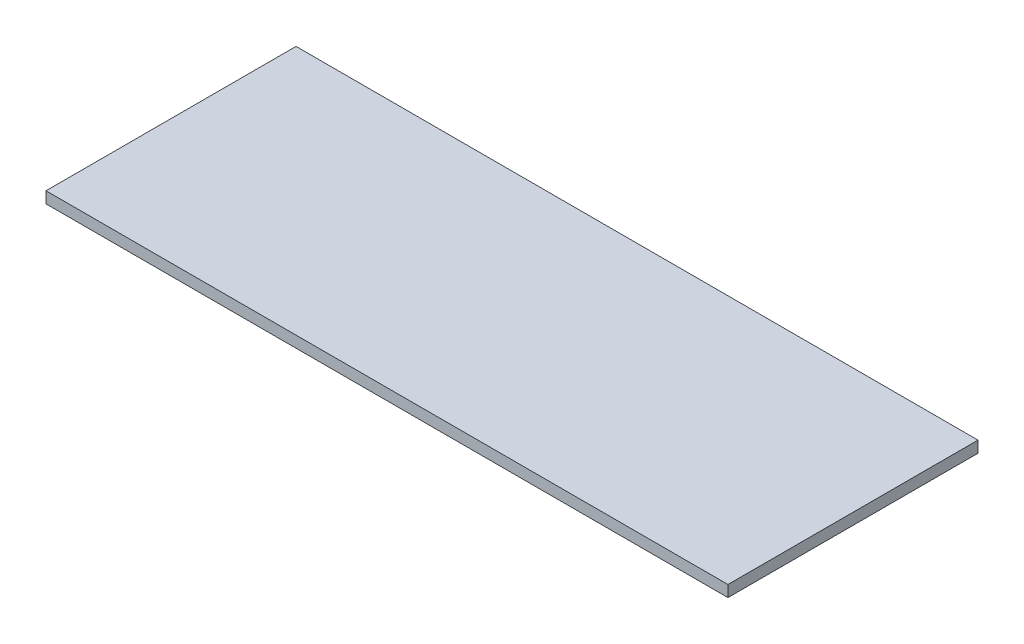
from build123d import *

# Parameters (mm, degrees)
SKETCH1_W           = 300
SKETCH1_H           = 110
BOSS_EXTRUDE1_DEPTH = 5


with BuildPart() as part:
    # Sketch1 → Boss-Extrude1 (new body)
    with BuildSketch(Plane(origin=(0, 0, 0), x_dir=(1, 0, 0), z_dir=(0, 1, 0))):
        Rectangle(SKETCH1_W, SKETCH1_H)
    extrude(amount=-BOSS_EXTRUDE1_DEPTH)


solid = part.part
